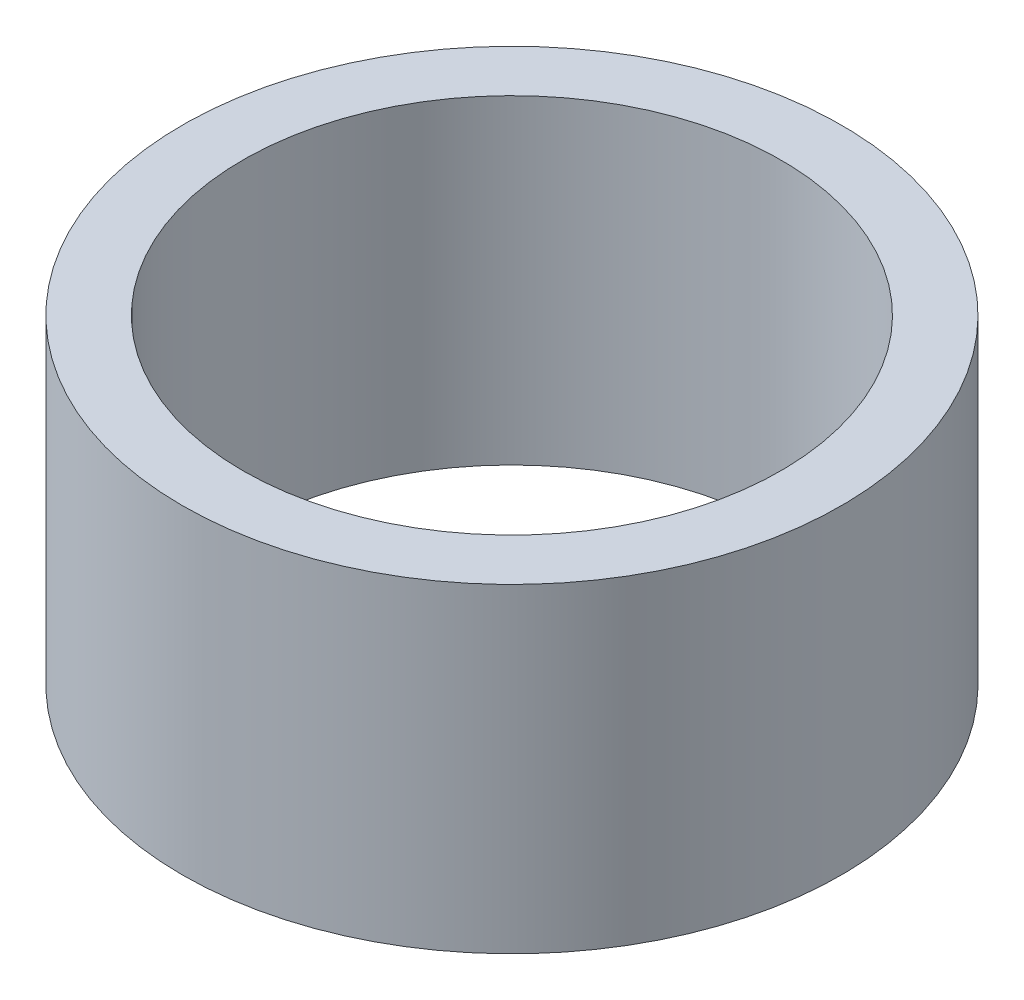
ISO-10303-21;
HEADER;
FILE_DESCRIPTION(('STEP AP214'),'2;1');
FILE_NAME('part.step','',(''),(''),'','','');
FILE_SCHEMA(('AUTOMOTIVE_DESIGN { 1 0 10303 214 1 1 1 1 }'));
ENDSEC;
DATA;
#1=APPLICATION_CONTEXT('core data for automotive mechanical design processes');
#2=APPLICATION_PROTOCOL_DEFINITION('international standard','automotive_design',2000,#1);
#3=PRODUCT_CONTEXT('',#1,'mechanical');
#4=PRODUCT('Part','Part','',(#3));
#5=PRODUCT_RELATED_PRODUCT_CATEGORY('part','',(#4));
#6=PRODUCT_DEFINITION_FORMATION('','',#4);
#7=PRODUCT_DEFINITION_CONTEXT('part definition',#1,'design');
#8=PRODUCT_DEFINITION('design','',#6,#7);
#9=PRODUCT_DEFINITION_SHAPE('','',#8);
#10=(LENGTH_UNIT() NAMED_UNIT(*) SI_UNIT(.MILLI.,.METRE.));
#11=(NAMED_UNIT(*) PLANE_ANGLE_UNIT() SI_UNIT($,.RADIAN.));
#12=(NAMED_UNIT(*) SI_UNIT($,.STERADIAN.) SOLID_ANGLE_UNIT());
#13=UNCERTAINTY_MEASURE_WITH_UNIT(LENGTH_MEASURE(1.E-05),#10,'distance_accuracy_value','');
#14=(GEOMETRIC_REPRESENTATION_CONTEXT(3) GLOBAL_UNCERTAINTY_ASSIGNED_CONTEXT((#13)) GLOBAL_UNIT_ASSIGNED_CONTEXT((#10,
#11,#12)) REPRESENTATION_CONTEXT('',''));
#15=CARTESIAN_POINT('',(0.,0.,0.));
#16=DIRECTION('',(0.,0.,1.));
#17=DIRECTION('',(1.,0.,0.));
#18=AXIS2_PLACEMENT_3D('',#15,#16,#17);
#19=CARTESIAN_POINT('',(0.,33.58896,0.));
#20=DIRECTION('',(0.,1.,0.));
#21=DIRECTION('',(0.,0.,1.));
#22=AXIS2_PLACEMENT_3D('',#19,#20,#21);
#23=PLANE('',#22);
#24=CARTESIAN_POINT('',(0.,33.58896,0.));
#25=DIRECTION('',(0.,1.,0.));
#26=DIRECTION('',(0.,0.,1.));
#27=AXIS2_PLACEMENT_3D('',#24,#25,#26);
#28=CIRCLE('',#27,34.6075);
#29=CARTESIAN_POINT('',(0.,33.58896,34.6075));
#30=VERTEX_POINT('',#29);
#31=EDGE_CURVE('E10',#30,#30,#28,.T.);
#32=ORIENTED_EDGE('',*,*,#31,.T.);
#33=EDGE_LOOP('',(#32));
#34=FACE_BOUND('',#33,.T.);
#35=CARTESIAN_POINT('',(0.,33.58896,0.));
#36=DIRECTION('',(0.,1.,0.));
#37=DIRECTION('',(0.,0.,1.));
#38=AXIS2_PLACEMENT_3D('',#35,#36,#37);
#39=CIRCLE('',#38,28.2575);
#40=CARTESIAN_POINT('',(0.,33.58896,28.2575));
#41=VERTEX_POINT('',#40);
#42=EDGE_CURVE('E56',#41,#41,#39,.T.);
#43=ORIENTED_EDGE('',*,*,#42,.F.);
#44=EDGE_LOOP('',(#43));
#45=FACE_BOUND('',#44,.T.);
#46=ADVANCED_FACE('F43',(#34,#45),#23,.T.);
#47=CARTESIAN_POINT('',(0.,0.,0.));
#48=DIRECTION('',(0.,1.,0.));
#49=DIRECTION('',(0.,0.,1.));
#50=AXIS2_PLACEMENT_3D('',#47,#48,#49);
#51=PLANE('',#50);
#52=CARTESIAN_POINT('',(0.,0.,0.));
#53=DIRECTION('',(0.,1.,0.));
#54=DIRECTION('',(0.,0.,1.));
#55=AXIS2_PLACEMENT_3D('',#52,#53,#54);
#56=CIRCLE('',#55,34.6075);
#57=CARTESIAN_POINT('',(0.,0.,34.6075));
#58=VERTEX_POINT('',#57);
#59=EDGE_CURVE('E47',#58,#58,#56,.T.);
#60=ORIENTED_EDGE('',*,*,#59,.F.);
#61=EDGE_LOOP('',(#60));
#62=FACE_BOUND('',#61,.T.);
#63=CARTESIAN_POINT('',(0.,0.,0.));
#64=DIRECTION('',(0.,1.,0.));
#65=DIRECTION('',(0.,0.,1.));
#66=AXIS2_PLACEMENT_3D('',#63,#64,#65);
#67=CIRCLE('',#66,28.2575);
#68=CARTESIAN_POINT('',(0.,0.,28.2575));
#69=VERTEX_POINT('',#68);
#70=EDGE_CURVE('E58',#69,#69,#67,.T.);
#71=ORIENTED_EDGE('',*,*,#70,.T.);
#72=EDGE_LOOP('',(#71));
#73=FACE_BOUND('',#72,.T.);
#74=ADVANCED_FACE('F70',(#62,#73),#51,.F.);
#75=CARTESIAN_POINT('',(0.,33.58896,0.));
#76=DIRECTION('',(0.,-1.,0.));
#77=DIRECTION('',(0.,0.,-1.));
#78=AXIS2_PLACEMENT_3D('',#75,#76,#77);
#79=CYLINDRICAL_SURFACE('',#78,34.6075);
#80=ORIENTED_EDGE('',*,*,#31,.F.);
#81=EDGE_LOOP('',(#80));
#82=FACE_BOUND('',#81,.T.);
#83=ORIENTED_EDGE('',*,*,#59,.T.);
#84=EDGE_LOOP('',(#83));
#85=FACE_BOUND('',#84,.T.);
#86=ADVANCED_FACE('F45',(#82,#85),#79,.T.);
#87=CARTESIAN_POINT('',(0.,33.58896,0.));
#88=DIRECTION('',(0.,-1.,0.));
#89=DIRECTION('',(0.,0.,-1.));
#90=AXIS2_PLACEMENT_3D('',#87,#88,#89);
#91=CYLINDRICAL_SURFACE('',#90,28.2575);
#92=ORIENTED_EDGE('',*,*,#42,.T.);
#93=EDGE_LOOP('',(#92));
#94=FACE_BOUND('',#93,.T.);
#95=ORIENTED_EDGE('',*,*,#70,.F.);
#96=EDGE_LOOP('',(#95));
#97=FACE_BOUND('',#96,.T.);
#98=ADVANCED_FACE('F66',(#94,#97),#91,.F.);
#99=CLOSED_SHELL('',(#46,#74,#86,#98));
#100=MANIFOLD_SOLID_BREP('B2',#99);
#101=ADVANCED_BREP_SHAPE_REPRESENTATION('',(#18,#100),#14);
#102=SHAPE_DEFINITION_REPRESENTATION(#9,#101);
ENDSEC;
END-ISO-10303-21;
